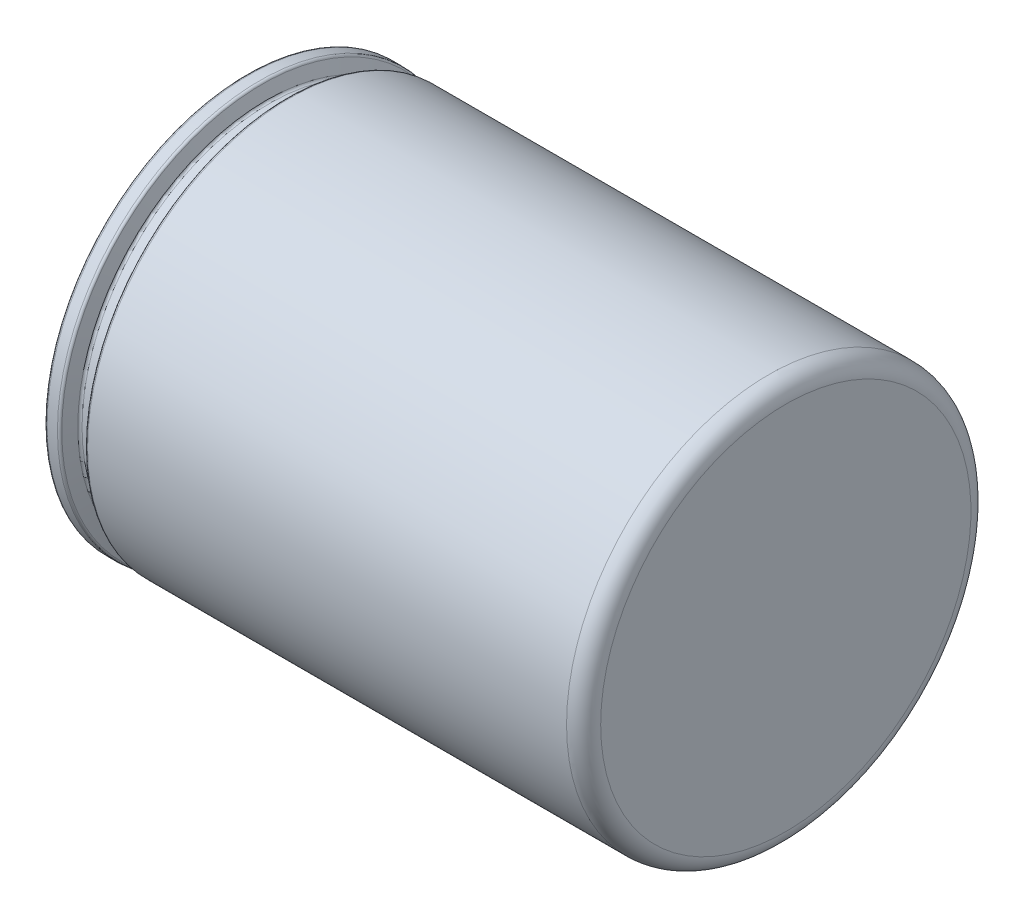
from build123d import *


with BuildPart() as part:
    # Sketch1 → Revolve1 (revolve)
    with BuildSketch(Plane.XY, mode=Mode.PRIVATE) as revolve1_sk:
        with BuildLine():
            Line((152.4, 0), (152.4, 52.324))
            ThreePointArc((152.4, 52.324), (150.986497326, 55.736497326), (147.574, 57.15))
            Line((147.574, 57.15), (12.192, 57.15))
            ThreePointArc((12.192, 57.15), (11.653184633, 56.926815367), (11.43, 56.388))
            Line((11.43, 56.388), (11.43, 53.594))
            ThreePointArc((11.43, 53.594), (11.206815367, 53.055184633), (10.668, 52.832))
            Line((10.668, 52.832), (6.321581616, 52.832))
            ThreePointArc((6.321581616, 52.832), (5.884516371, 52.969806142), (5.605535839, 53.333380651))
            Line((5.605535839, 53.333380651), (4.398887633, 56.648619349))
            ThreePointArc((4.398887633, 56.648619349), (4.1199071, 57.012193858), (3.682841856, 57.15))
            Line((3.682841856, 57.15), (0.762, 57.15))
            ThreePointArc((0.762, 57.15), (0.223184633, 56.926815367), (0, 56.388))
            Line((0, 56.388), (0, 49.149))
            ThreePointArc((0, 49.149), (0.446369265, 48.071369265), (1.524, 47.625))
            Line((1.524, 47.625), (125.349, 47.625))
            ThreePointArc((125.349, 47.625), (127.59406403, 46.69506403), (128.524, 44.45))
            Line((128.524, 44.45), (128.524, 0))
            Line((128.524, 0), (152.4, 0))
        make_face()
    revolve(revolve1_sk.sketch.rotate(Axis((0, 0, 0), (1, 0, 0)), 90), axis=Axis((0, 0, 0), (1, 0, 0)))


solid = part.part
